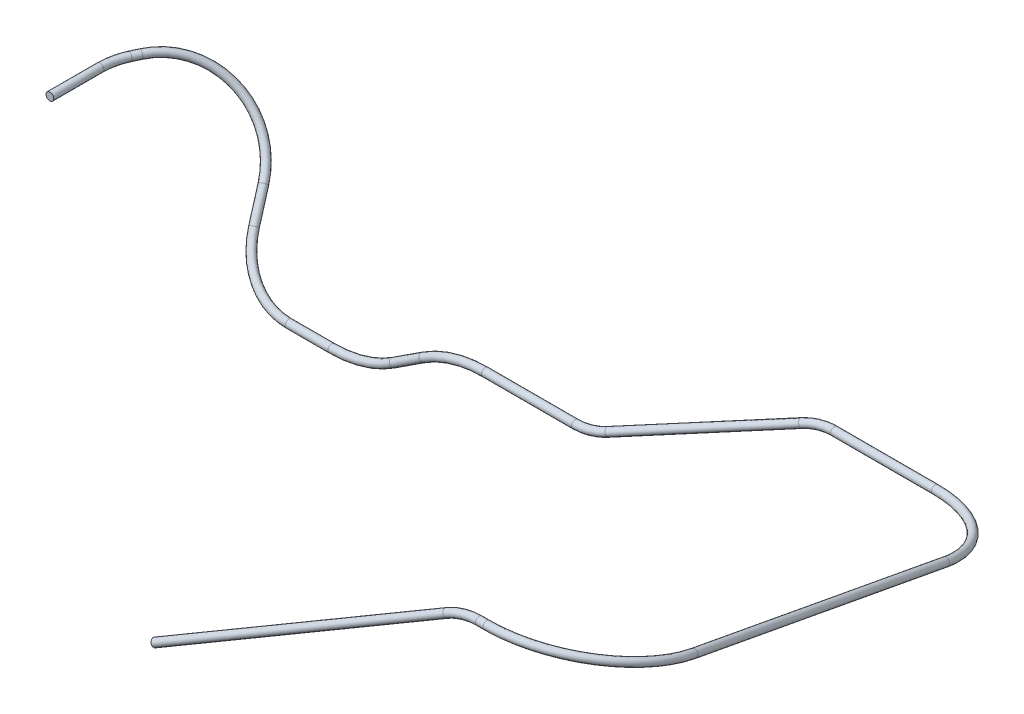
ISO-10303-21;
HEADER;
FILE_DESCRIPTION(('STEP AP214'),'2;1');
FILE_NAME('part.step','',(''),(''),'','','');
FILE_SCHEMA(('AUTOMOTIVE_DESIGN { 1 0 10303 214 1 1 1 1 }'));
ENDSEC;
DATA;
#1=APPLICATION_CONTEXT('core data for automotive mechanical design processes');
#2=APPLICATION_PROTOCOL_DEFINITION('international standard','automotive_design',2000,#1);
#3=PRODUCT_CONTEXT('',#1,'mechanical');
#4=PRODUCT('Part','Part','',(#3));
#5=PRODUCT_RELATED_PRODUCT_CATEGORY('part','',(#4));
#6=PRODUCT_DEFINITION_FORMATION('','',#4);
#7=PRODUCT_DEFINITION_CONTEXT('part definition',#1,'design');
#8=PRODUCT_DEFINITION('design','',#6,#7);
#9=PRODUCT_DEFINITION_SHAPE('','',#8);
#10=(LENGTH_UNIT() NAMED_UNIT(*) SI_UNIT(.MILLI.,.METRE.));
#11=(NAMED_UNIT(*) PLANE_ANGLE_UNIT() SI_UNIT($,.RADIAN.));
#12=(NAMED_UNIT(*) SI_UNIT($,.STERADIAN.) SOLID_ANGLE_UNIT());
#13=UNCERTAINTY_MEASURE_WITH_UNIT(LENGTH_MEASURE(1.E-05),#10,'distance_accuracy_value','');
#14=(GEOMETRIC_REPRESENTATION_CONTEXT(3) GLOBAL_UNCERTAINTY_ASSIGNED_CONTEXT((#13)) GLOBAL_UNIT_ASSIGNED_CONTEXT((#10,
#11,#12)) REPRESENTATION_CONTEXT('',''));
#15=CARTESIAN_POINT('',(0.,0.,0.));
#16=DIRECTION('',(0.,0.,1.));
#17=DIRECTION('',(1.,0.,0.));
#18=AXIS2_PLACEMENT_3D('',#15,#16,#17);
#19=CARTESIAN_POINT('',(0.,0.,0.));
#20=DIRECTION('',(0.,0.,1.));
#21=DIRECTION('',(1.,0.,0.));
#22=AXIS2_PLACEMENT_3D('',#19,#20,#21);
#23=PLANE('',#22);
#24=CARTESIAN_POINT('',(0.,0.,0.));
#25=DIRECTION('',(0.,0.,-1.));
#26=DIRECTION('',(-1.,0.,0.));
#27=AXIS2_PLACEMENT_3D('',#24,#25,#26);
#28=CIRCLE('',#27,0.7747);
#29=CARTESIAN_POINT('',(-0.7747,0.,0.));
#30=VERTEX_POINT('',#29);
#31=EDGE_CURVE('E18',#30,#30,#28,.T.);
#32=ORIENTED_EDGE('',*,*,#31,.F.);
#33=EDGE_LOOP('',(#32));
#34=FACE_BOUND('',#33,.T.);
#35=ADVANCED_FACE('F15',(#34),#23,.T.);
#36=CARTESIAN_POINT('',(0.,0.,0.));
#37=DIRECTION('',(0.,0.,-1.));
#38=DIRECTION('',(-1.,0.,0.));
#39=AXIS2_PLACEMENT_3D('',#36,#37,#38);
#40=CYLINDRICAL_SURFACE('',#39,0.7747);
#41=ORIENTED_EDGE('',*,*,#31,.T.);
#42=EDGE_LOOP('',(#41));
#43=FACE_BOUND('',#42,.T.);
#44=CARTESIAN_POINT('',(0.,0.,-10.1008338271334));
#45=DIRECTION('',(0.,0.,-1.));
#46=DIRECTION('',(-0.998630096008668,0.0523252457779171,0.));
#47=AXIS2_PLACEMENT_3D('',#44,#45,#46);
#48=CIRCLE('',#47,0.7747);
#49=CARTESIAN_POINT('',(-0.773638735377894,0.0405363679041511,-10.1008338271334));
#50=VERTEX_POINT('',#49);
#51=EDGE_CURVE('E198',#50,#50,#48,.T.);
#52=ORIENTED_EDGE('',*,*,#51,.F.);
#53=EDGE_LOOP('',(#52));
#54=FACE_BOUND('',#53,.T.);
#55=ADVANCED_FACE('F191',(#43,#54),#40,.T.);
#56=CARTESIAN_POINT('',(12.6826022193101,-0.664530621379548,-10.1008338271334));
#57=DIRECTION('',(-0.0523252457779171,-0.998630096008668,0.));
#58=DIRECTION('',(0.998630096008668,-0.0523252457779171,0.));
#59=AXIS2_PLACEMENT_3D('',#56,#57,#58);
#60=TOROIDAL_SURFACE('',#59,12.7,0.7747);
#61=ORIENTED_EDGE('',*,*,#51,.T.);
#62=EDGE_LOOP('',(#61));
#63=FACE_BOUND('',#62,.T.);
#64=CARTESIAN_POINT('',(1.01971579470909,-0.0534300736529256,-15.0901861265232));
#65=DIRECTION('',(0.392324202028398,-0.0205566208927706,-0.919597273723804));
#66=DIRECTION('',(-0.919791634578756,0.,-0.392407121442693));
#67=AXIS2_PLACEMENT_3D('',#64,#65,#66);
#68=CIRCLE('',#67,0.7747);
#69=CARTESIAN_POINT('',(0.307153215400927,-0.0534300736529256,-15.3941839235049));
#70=VERTEX_POINT('',#69);
#71=EDGE_CURVE('E201',#70,#70,#68,.T.);
#72=ORIENTED_EDGE('',*,*,#71,.F.);
#73=EDGE_LOOP('',(#72));
#74=FACE_BOUND('',#73,.T.);
#75=ADVANCED_FACE('F187',(#63,#74),#60,.T.);
#76=CARTESIAN_POINT('',(1.01971579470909,-0.0534300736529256,-15.0901861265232));
#77=DIRECTION('',(0.392324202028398,-0.0205566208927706,-0.919597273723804));
#78=DIRECTION('',(-0.919791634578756,0.,-0.392407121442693));
#79=AXIS2_PLACEMENT_3D('',#76,#77,#78);
#80=CYLINDRICAL_SURFACE('',#79,0.7747);
#81=ORIENTED_EDGE('',*,*,#71,.T.);
#82=EDGE_LOOP('',(#81));
#83=FACE_BOUND('',#82,.T.);
#84=CARTESIAN_POINT('',(1.67497659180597,-0.0877637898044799,-16.6260996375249));
#85=DIRECTION('',(0.392324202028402,-0.0205566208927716,-0.919597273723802));
#86=DIRECTION('',(-0.583290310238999,0.767473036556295,-0.266002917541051));
#87=AXIS2_PLACEMENT_3D('',#84,#85,#86);
#88=CIRCLE('',#87,0.7747);
#89=CARTESIAN_POINT('',(1.22310158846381,0.506797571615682,-16.8321720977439));
#90=VERTEX_POINT('',#89);
#91=EDGE_CURVE('E174',#90,#90,#88,.T.);
#92=ORIENTED_EDGE('',*,*,#91,.F.);
#93=EDGE_LOOP('',(#92));
#94=FACE_BOUND('',#93,.T.);
#95=ADVANCED_FACE('F183',(#83,#94),#80,.T.);
#96=CARTESIAN_POINT('',(10.4785734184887,-11.6712292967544,-12.6113193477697));
#97=DIRECTION('',(-0.71123423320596,-0.640751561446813,-0.289107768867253));
#98=DIRECTION('',(0.702955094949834,-0.648298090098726,-0.292512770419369));
#99=AXIS2_PLACEMENT_3D('',#96,#97,#98);
#100=TOROIDAL_SURFACE('',#99,15.09299344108,0.7747);
#101=ORIENTED_EDGE('',*,*,#91,.T.);
#102=EDGE_LOOP('',(#101));
#103=FACE_BOUND('',#102,.T.);
#104=CARTESIAN_POINT('',(19.688568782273,-17.0835573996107,-23.2734551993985));
#105=DIRECTION('',(0.348972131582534,-0.678855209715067,0.646044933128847));
#106=DIRECTION('',(0.,-0.68938439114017,-0.724395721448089));
#107=AXIS2_PLACEMENT_3D('',#104,#105,#106);
#108=CIRCLE('',#107,0.774700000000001);
#109=CARTESIAN_POINT('',(19.688568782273,-17.617623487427,-23.8346445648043));
#110=VERTEX_POINT('',#109);
#111=EDGE_CURVE('E169',#110,#110,#108,.T.);
#112=ORIENTED_EDGE('',*,*,#111,.F.);
#113=EDGE_LOOP('',(#112));
#114=FACE_BOUND('',#113,.T.);
#115=ADVANCED_FACE('F180',(#103,#114),#100,.T.);
#116=CARTESIAN_POINT('',(19.688568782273,-17.0835573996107,-23.2734551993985));
#117=DIRECTION('',(0.348972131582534,-0.678855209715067,0.646044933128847));
#118=DIRECTION('',(0.,-0.68938439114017,-0.724395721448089));
#119=AXIS2_PLACEMENT_3D('',#116,#117,#118);
#120=CYLINDRICAL_SURFACE('',#119,0.774700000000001);
#121=ORIENTED_EDGE('',*,*,#111,.T.);
#122=EDGE_LOOP('',(#121));
#123=FACE_BOUND('',#122,.T.);
#124=CARTESIAN_POINT('',(21.9045418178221,-21.3942879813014,-19.1710698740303));
#125=DIRECTION('',(0.348972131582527,-0.678855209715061,0.646044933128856));
#126=DIRECTION('',(-0.937133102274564,-0.252793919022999,0.24057594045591));
#127=AXIS2_PLACEMENT_3D('',#124,#125,#126);
#128=CIRCLE('',#127,0.774700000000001);
#129=CARTESIAN_POINT('',(21.17854480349,-21.5901274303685,-18.9846956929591));
#130=VERTEX_POINT('',#129);
#131=EDGE_CURVE('E165',#130,#130,#128,.T.);
#132=ORIENTED_EDGE('',*,*,#131,.F.);
#133=EDGE_LOOP('',(#132));
#134=FACE_BOUND('',#133,.T.);
#135=ADVANCED_FACE('F157',(#123,#134),#120,.T.);
#136=CARTESIAN_POINT('',(35.4164393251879,-17.7494209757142,-22.6397739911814));
#137=DIRECTION('',(0.,0.689384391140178,0.724395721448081));
#138=DIRECTION('',(1.,0.,0.));
#139=AXIS2_PLACEMENT_3D('',#136,#137,#138);
#140=TOROIDAL_SURFACE('',#139,14.4183333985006,0.774700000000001);
#141=ORIENTED_EDGE('',*,*,#131,.T.);
#142=EDGE_LOOP('',(#141));
#143=FACE_BOUND('',#142,.T.);
#144=CARTESIAN_POINT('',(35.4164393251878,-28.194,-12.7));
#145=DIRECTION('',(1.,0.,0.));
#146=DIRECTION('',(0.,0.,-1.));
#147=AXIS2_PLACEMENT_3D('',#144,#145,#146);
#148=CIRCLE('',#147,0.774700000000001);
#149=CARTESIAN_POINT('',(35.4164393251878,-28.194,-13.4747));
#150=VERTEX_POINT('',#149);
#151=EDGE_CURVE('E168',#150,#150,#148,.T.);
#152=ORIENTED_EDGE('',*,*,#151,.F.);
#153=EDGE_LOOP('',(#152));
#154=FACE_BOUND('',#153,.T.);
#155=ADVANCED_FACE('F152',(#143,#154),#140,.T.);
#156=CARTESIAN_POINT('',(35.4164393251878,-28.194,-12.7));
#157=DIRECTION('',(1.,0.,0.));
#158=DIRECTION('',(0.,0.,-1.));
#159=AXIS2_PLACEMENT_3D('',#156,#157,#158);
#160=CYLINDRICAL_SURFACE('',#159,0.774700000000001);
#161=ORIENTED_EDGE('',*,*,#151,.T.);
#162=EDGE_LOOP('',(#161));
#163=FACE_BOUND('',#162,.T.);
#164=CARTESIAN_POINT('',(44.0021066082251,-28.194,-12.7));
#165=DIRECTION('',(1.,0.,0.));
#166=DIRECTION('',(0.,-1.,0.));
#167=AXIS2_PLACEMENT_3D('',#164,#165,#166);
#168=CIRCLE('',#167,0.774700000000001);
#169=CARTESIAN_POINT('',(44.0021066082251,-28.9687,-12.7));
#170=VERTEX_POINT('',#169);
#171=EDGE_CURVE('E139',#170,#170,#168,.T.);
#172=ORIENTED_EDGE('',*,*,#171,.F.);
#173=EDGE_LOOP('',(#172));
#174=FACE_BOUND('',#173,.T.);
#175=ADVANCED_FACE('F148',(#163,#174),#160,.T.);
#176=CARTESIAN_POINT('',(44.0021066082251,-5.334,-12.7));
#177=DIRECTION('',(0.,0.,1.));
#178=DIRECTION('',(1.,0.,0.));
#179=AXIS2_PLACEMENT_3D('',#176,#177,#178);
#180=TOROIDAL_SURFACE('',#179,22.86,0.774700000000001);
#181=ORIENTED_EDGE('',*,*,#171,.T.);
#182=EDGE_LOOP('',(#181));
#183=FACE_BOUND('',#182,.T.);
#184=CARTESIAN_POINT('',(56.493305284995,-24.4794839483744,-12.7));
#185=DIRECTION('',(0.83751023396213,0.546421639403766,0.));
#186=DIRECTION('',(-0.546421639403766,0.83751023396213,0.));
#187=AXIS2_PLACEMENT_3D('',#184,#185,#186);
#188=CIRCLE('',#187,0.774700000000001);
#189=CARTESIAN_POINT('',(56.0699924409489,-23.8306647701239,-12.7));
#190=VERTEX_POINT('',#189);
#191=EDGE_CURVE('E134',#190,#190,#188,.T.);
#192=ORIENTED_EDGE('',*,*,#191,.F.);
#193=EDGE_LOOP('',(#192));
#194=FACE_BOUND('',#193,.T.);
#195=ADVANCED_FACE('F145',(#183,#194),#180,.T.);
#196=CARTESIAN_POINT('',(56.493305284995,-24.4794839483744,-12.7));
#197=DIRECTION('',(0.83751023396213,0.546421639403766,0.));
#198=DIRECTION('',(-0.546421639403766,0.83751023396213,0.));
#199=AXIS2_PLACEMENT_3D('',#196,#197,#198);
#200=CYLINDRICAL_SURFACE('',#199,0.774700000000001);
#201=ORIENTED_EDGE('',*,*,#191,.T.);
#202=EDGE_LOOP('',(#201));
#203=FACE_BOUND('',#202,.T.);
#204=CARTESIAN_POINT('',(62.4112423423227,-20.6184100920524,-12.7));
#205=DIRECTION('',(0.837510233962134,0.546421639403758,0.));
#206=DIRECTION('',(-0.546421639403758,0.837510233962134,0.));
#207=AXIS2_PLACEMENT_3D('',#204,#205,#206);
#208=CIRCLE('',#207,0.774700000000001);
#209=CARTESIAN_POINT('',(61.9879294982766,-19.969590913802,-12.7));
#210=VERTEX_POINT('',#209);
#211=EDGE_CURVE('E130',#210,#210,#208,.T.);
#212=ORIENTED_EDGE('',*,*,#211,.F.);
#213=EDGE_LOOP('',(#212));
#214=FACE_BOUND('',#213,.T.);
#215=ADVANCED_FACE('F122',(#203,#214),#200,.T.);
#216=CARTESIAN_POINT('',(74.9024410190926,-39.7638940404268,-12.7));
#217=DIRECTION('',(0.,0.,-1.));
#218=DIRECTION('',(1.,0.,0.));
#219=AXIS2_PLACEMENT_3D('',#216,#217,#218);
#220=TOROIDAL_SURFACE('',#219,22.86,0.774700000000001);
#221=ORIENTED_EDGE('',*,*,#211,.T.);
#222=EDGE_LOOP('',(#221));
#223=FACE_BOUND('',#222,.T.);
#224=CARTESIAN_POINT('',(74.9024410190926,-16.9038940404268,-12.7));
#225=DIRECTION('',(1.,0.,0.));
#226=DIRECTION('',(0.,0.,-1.));
#227=AXIS2_PLACEMENT_3D('',#224,#225,#226);
#228=CIRCLE('',#227,0.774700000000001);
#229=CARTESIAN_POINT('',(74.9024410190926,-16.9038940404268,-13.4747));
#230=VERTEX_POINT('',#229);
#231=EDGE_CURVE('E133',#230,#230,#228,.T.);
#232=ORIENTED_EDGE('',*,*,#231,.F.);
#233=EDGE_LOOP('',(#232));
#234=FACE_BOUND('',#233,.T.);
#235=ADVANCED_FACE('F117',(#223,#234),#220,.T.);
#236=CARTESIAN_POINT('',(74.9024410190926,-16.9038940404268,-12.7));
#237=DIRECTION('',(1.,0.,0.));
#238=DIRECTION('',(0.,0.,-1.));
#239=AXIS2_PLACEMENT_3D('',#236,#237,#238);
#240=CYLINDRICAL_SURFACE('',#239,0.774700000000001);
#241=ORIENTED_EDGE('',*,*,#231,.T.);
#242=EDGE_LOOP('',(#241));
#243=FACE_BOUND('',#242,.T.);
#244=CARTESIAN_POINT('',(93.0384381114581,-16.9038940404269,-12.7));
#245=DIRECTION('',(1.,0.,0.));
#246=DIRECTION('',(0.,-0.779129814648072,0.626862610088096));
#247=AXIS2_PLACEMENT_3D('',#244,#245,#246);
#248=CIRCLE('',#247,0.774700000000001);
#249=CARTESIAN_POINT('',(93.0384381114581,-17.5074859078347,-12.2143695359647));
#250=VERTEX_POINT('',#249);
#251=EDGE_CURVE('E102',#250,#250,#248,.T.);
#252=ORIENTED_EDGE('',*,*,#251,.F.);
#253=EDGE_LOOP('',(#252));
#254=FACE_BOUND('',#253,.T.);
#255=ADVANCED_FACE('F113',(#243,#254),#240,.T.);
#256=CARTESIAN_POINT('',(98.9766772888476,-6.72868078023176,77.8585446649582));
#257=DIRECTION('',(0.878168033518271,0.454499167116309,-0.149169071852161));
#258=DIRECTION('',(-0.459641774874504,0.888104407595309,0.));
#259=AXIS2_PLACEMENT_3D('',#256,#257,#258);
#260=PLANE('',#259);
#261=CARTESIAN_POINT('',(98.9766772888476,-6.72868078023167,77.8585446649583));
#262=DIRECTION('',(-0.878168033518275,-0.454499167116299,0.149169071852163));
#263=DIRECTION('',(0.459641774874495,-0.888104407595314,0.));
#264=AXIS2_PLACEMENT_3D('',#261,#262,#263);
#265=CIRCLE('',#264,0.774700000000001);
#266=CARTESIAN_POINT('',(99.3327617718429,-7.41669526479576,77.8585446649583));
#267=VERTEX_POINT('',#266);
#268=EDGE_CURVE('E97',#267,#267,#265,.F.);
#269=ORIENTED_EDGE('',*,*,#268,.F.);
#270=EDGE_LOOP('',(#269));
#271=FACE_BOUND('',#270,.T.);
#272=ADVANCED_FACE('F109',(#271),#260,.F.);
#273=CARTESIAN_POINT('',(93.0384381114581,-7.00894539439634,-20.6611551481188));
#274=DIRECTION('',(0.,0.626862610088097,0.779129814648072));
#275=DIRECTION('',(1.,0.,0.));
#276=AXIS2_PLACEMENT_3D('',#273,#274,#275);
#277=TOROIDAL_SURFACE('',#276,12.7,0.774700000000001);
#278=ORIENTED_EDGE('',*,*,#251,.T.);
#279=EDGE_LOOP('',(#278));
#280=FACE_BOUND('',#279,.T.);
#281=CARTESIAN_POINT('',(98.7661993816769,-15.8403999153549,-13.5556529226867));
#282=DIRECTION('',(0.892521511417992,0.351391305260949,-0.282718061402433));
#283=DIRECTION('',(-0.366336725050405,0.930482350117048,0.));
#284=AXIS2_PLACEMENT_3D('',#281,#282,#283);
#285=CIRCLE('',#284,0.774700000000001);
#286=CARTESIAN_POINT('',(98.4823983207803,-15.1195552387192,-13.5556529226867));
#287=VERTEX_POINT('',#286);
#288=EDGE_CURVE('E92',#287,#287,#285,.T.);
#289=ORIENTED_EDGE('',*,*,#288,.F.);
#290=EDGE_LOOP('',(#289));
#291=FACE_BOUND('',#290,.T.);
#292=ADVANCED_FACE('F105',(#280,#291),#277,.T.);
#293=CARTESIAN_POINT('',(149.163980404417,19.2459466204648,69.3335322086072));
#294=DIRECTION('',(-0.878168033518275,-0.454499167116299,0.149169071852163));
#295=DIRECTION('',(0.459641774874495,-0.888104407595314,0.));
#296=AXIS2_PLACEMENT_3D('',#293,#294,#295);
#297=CYLINDRICAL_SURFACE('',#296,0.774700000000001);
#298=CARTESIAN_POINT('',(149.163980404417,19.2459466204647,69.3335322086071));
#299=DIRECTION('',(-0.87816803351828,-0.454499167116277,0.1491690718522));
#300=DIRECTION('',(-0.478352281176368,0.834378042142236,-0.273847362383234));
#301=AXIS2_PLACEMENT_3D('',#298,#299,#300);
#302=CIRCLE('',#301,0.774700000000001);
#303=CARTESIAN_POINT('',(148.79340089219,19.8923392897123,69.1213826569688));
#304=VERTEX_POINT('',#303);
#305=EDGE_CURVE('E89',#304,#304,#302,.F.);
#306=ORIENTED_EDGE('',*,*,#305,.F.);
#307=EDGE_LOOP('',(#306));
#308=FACE_BOUND('',#307,.T.);
#309=ORIENTED_EDGE('',*,*,#268,.T.);
#310=EDGE_LOOP('',(#309));
#311=FACE_BOUND('',#310,.T.);
#312=ADVANCED_FACE('F108',(#308,#311),#297,.T.);
#313=CARTESIAN_POINT('',(98.7661993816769,-15.8403999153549,-13.5556529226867));
#314=DIRECTION('',(0.892521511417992,0.351391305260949,-0.282718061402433));
#315=DIRECTION('',(-0.366336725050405,0.930482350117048,0.));
#316=AXIS2_PLACEMENT_3D('',#313,#314,#315);
#317=CYLINDRICAL_SURFACE('',#316,0.774700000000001);
#318=ORIENTED_EDGE('',*,*,#288,.T.);
#319=EDGE_LOOP('',(#318));
#320=FACE_BOUND('',#319,.T.);
#321=CARTESIAN_POINT('',(128.344262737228,-4.19533124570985,-22.9248979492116));
#322=DIRECTION('',(0.892521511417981,0.351391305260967,-0.282718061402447));
#323=DIRECTION('',(-0.451004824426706,0.695390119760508,-0.559488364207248));
#324=AXIS2_PLACEMENT_3D('',#321,#322,#323);
#325=CIRCLE('',#324,0.774700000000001);
#326=CARTESIAN_POINT('',(127.994869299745,-3.65661251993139,-23.358333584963));
#327=VERTEX_POINT('',#326);
#328=EDGE_CURVE('E67',#327,#327,#325,.T.);
#329=ORIENTED_EDGE('',*,*,#328,.F.);
#330=EDGE_LOOP('',(#329));
#331=FACE_BOUND('',#330,.T.);
#332=ADVANCED_FACE('F83',(#320,#331),#317,.T.);
#333=CARTESIAN_POINT('',(155.239054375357,8.64934548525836,72.8113937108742));
#334=DIRECTION('',(0.,0.311839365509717,0.95013483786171));
#335=DIRECTION('',(1.,0.,0.));
#336=AXIS2_PLACEMENT_3D('',#333,#334,#335);
#337=TOROIDAL_SURFACE('',#336,12.7,0.774700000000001);
#338=CARTESIAN_POINT('',(155.239054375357,20.7160579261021,68.8510337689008));
#339=DIRECTION('',(-1.,0.,0.));
#340=DIRECTION('',(0.,0.,1.));
#341=AXIS2_PLACEMENT_3D('',#338,#339,#340);
#342=CIRCLE('',#341,0.774700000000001);
#343=CARTESIAN_POINT('',(155.239054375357,20.7160579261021,69.6257337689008));
#344=VERTEX_POINT('',#343);
#345=EDGE_CURVE('E62',#344,#344,#342,.F.);
#346=ORIENTED_EDGE('',*,*,#345,.F.);
#347=EDGE_LOOP('',(#346));
#348=FACE_BOUND('',#347,.T.);
#349=ORIENTED_EDGE('',*,*,#305,.T.);
#350=EDGE_LOOP('',(#349));
#351=FACE_BOUND('',#350,.T.);
#352=ADVANCED_FACE('F78',(#348,#351),#337,.T.);
#353=CARTESIAN_POINT('',(134.072024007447,-13.0267857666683,-15.8193957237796));
#354=DIRECTION('',(0.,-0.626862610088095,-0.779129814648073));
#355=DIRECTION('',(1.,0.,0.));
#356=AXIS2_PLACEMENT_3D('',#353,#354,#355);
#357=TOROIDAL_SURFACE('',#356,12.7,0.774700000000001);
#358=ORIENTED_EDGE('',*,*,#328,.T.);
#359=EDGE_LOOP('',(#358));
#360=FACE_BOUND('',#359,.T.);
#361=CARTESIAN_POINT('',(134.072024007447,-3.13183712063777,-23.7805508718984));
#362=DIRECTION('',(1.,0.,0.));
#363=DIRECTION('',(0.,1.,0.));
#364=AXIS2_PLACEMENT_3D('',#361,#362,#363);
#365=CIRCLE('',#364,0.774700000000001);
#366=CARTESIAN_POINT('',(134.072024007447,-2.35713712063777,-23.7805508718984));
#367=VERTEX_POINT('',#366);
#368=EDGE_CURVE('E57',#367,#367,#365,.T.);
#369=ORIENTED_EDGE('',*,*,#368,.F.);
#370=EDGE_LOOP('',(#369));
#371=FACE_BOUND('',#370,.T.);
#372=ADVANCED_FACE('F74',(#360,#371),#357,.T.);
#373=CARTESIAN_POINT('',(156.782349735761,20.7160579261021,68.8510337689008));
#374=DIRECTION('',(-1.,0.,0.));
#375=DIRECTION('',(0.,0.,1.));
#376=AXIS2_PLACEMENT_3D('',#373,#374,#375);
#377=CYLINDRICAL_SURFACE('',#376,0.774700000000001);
#378=CARTESIAN_POINT('',(156.782349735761,20.7160579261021,68.8510337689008));
#379=DIRECTION('',(-1.,0.,0.));
#380=DIRECTION('',(0.,0.249318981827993,0.968421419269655));
#381=AXIS2_PLACEMENT_3D('',#378,#379,#380);
#382=CIRCLE('',#381,0.774700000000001);
#383=CARTESIAN_POINT('',(156.782349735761,20.9092053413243,69.601269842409));
#384=VERTEX_POINT('',#383);
#385=EDGE_CURVE('E54',#384,#384,#382,.F.);
#386=ORIENTED_EDGE('',*,*,#385,.F.);
#387=EDGE_LOOP('',(#386));
#388=FACE_BOUND('',#387,.T.);
#389=ORIENTED_EDGE('',*,*,#345,.T.);
#390=EDGE_LOOP('',(#389));
#391=FACE_BOUND('',#390,.T.);
#392=ADVANCED_FACE('F77',(#388,#391),#377,.T.);
#393=CARTESIAN_POINT('',(134.072024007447,-3.13183712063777,-23.7805508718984));
#394=DIRECTION('',(1.,0.,0.));
#395=DIRECTION('',(0.,1.,0.));
#396=AXIS2_PLACEMENT_3D('',#393,#394,#395);
#397=CYLINDRICAL_SURFACE('',#396,0.774700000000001);
#398=ORIENTED_EDGE('',*,*,#368,.T.);
#399=EDGE_LOOP('',(#398));
#400=FACE_BOUND('',#399,.T.);
#401=CARTESIAN_POINT('',(154.397864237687,-3.1318371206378,-23.7805508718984));
#402=DIRECTION('',(1.,0.,0.));
#403=DIRECTION('',(0.,-0.249318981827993,-0.968421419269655));
#404=AXIS2_PLACEMENT_3D('',#401,#402,#403);
#405=CIRCLE('',#404,0.774700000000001);
#406=CARTESIAN_POINT('',(154.397864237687,-3.32498453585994,-24.5307869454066));
#407=VERTEX_POINT('',#406);
#408=EDGE_CURVE('E27',#407,#407,#405,.T.);
#409=ORIENTED_EDGE('',*,*,#408,.F.);
#410=EDGE_LOOP('',(#409));
#411=FACE_BOUND('',#410,.T.);
#412=ADVANCED_FACE('F48',(#400,#411),#397,.T.);
#413=CARTESIAN_POINT('',(156.782349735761,15.6498962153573,49.1727105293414));
#414=DIRECTION('',(0.,-0.968421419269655,0.249318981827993));
#415=DIRECTION('',(1.,0.,0.));
#416=AXIS2_PLACEMENT_3D('',#413,#414,#415);
#417=TOROIDAL_SURFACE('',#416,20.32,0.774700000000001);
#418=CARTESIAN_POINT('',(177.028090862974,15.2171739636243,47.4919018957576));
#419=DIRECTION('',(0.0854142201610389,0.2484078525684,0.964882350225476));
#420=DIRECTION('',(0.,-0.968421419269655,0.249318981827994));
#421=AXIS2_PLACEMENT_3D('',#418,#419,#420);
#422=CIRCLE('',#421,0.774700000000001);
#423=CARTESIAN_POINT('',(177.028090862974,14.4669378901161,47.6850493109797));
#424=VERTEX_POINT('',#423);
#425=EDGE_CURVE('E22',#424,#424,#422,.F.);
#426=ORIENTED_EDGE('',*,*,#425,.F.);
#427=EDGE_LOOP('',(#426));
#428=FACE_BOUND('',#427,.T.);
#429=ORIENTED_EDGE('',*,*,#385,.T.);
#430=EDGE_LOOP('',(#429));
#431=FACE_BOUND('',#430,.T.);
#432=ADVANCED_FACE('F43',(#428,#431),#417,.T.);
#433=CARTESIAN_POINT('',(154.397864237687,1.30105437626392,-6.56201803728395));
#434=DIRECTION('',(0.,-0.968421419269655,0.249318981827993));
#435=DIRECTION('',(1.,0.,0.));
#436=AXIS2_PLACEMENT_3D('',#433,#434,#435);
#437=TOROIDAL_SURFACE('',#436,17.78,0.774700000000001);
#438=ORIENTED_EDGE('',*,*,#408,.T.);
#439=EDGE_LOOP('',(#438));
#440=FACE_BOUND('',#439,.T.);
#441=CARTESIAN_POINT('',(172.112887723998,0.922422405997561,-8.03272559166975));
#442=DIRECTION('',(0.0854142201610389,0.2484078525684,0.964882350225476));
#443=DIRECTION('',(0.,-0.968421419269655,0.249318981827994));
#444=AXIS2_PLACEMENT_3D('',#441,#442,#443);
#445=CIRCLE('',#444,0.774700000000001);
#446=CARTESIAN_POINT('',(172.112887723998,0.172186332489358,-7.83957817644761));
#447=VERTEX_POINT('',#446);
#448=EDGE_CURVE('E10',#447,#447,#445,.T.);
#449=ORIENTED_EDGE('',*,*,#448,.F.);
#450=EDGE_LOOP('',(#449));
#451=FACE_BOUND('',#450,.T.);
#452=ADVANCED_FACE('F38',(#440,#451),#437,.T.);
#453=CARTESIAN_POINT('',(172.112887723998,0.922422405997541,-8.03272559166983));
#454=DIRECTION('',(0.0854142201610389,0.2484078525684,0.964882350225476));
#455=DIRECTION('',(0.,-0.968421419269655,0.249318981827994));
#456=AXIS2_PLACEMENT_3D('',#453,#454,#455);
#457=CYLINDRICAL_SURFACE('',#456,0.774700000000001);
#458=ORIENTED_EDGE('',*,*,#448,.T.);
#459=EDGE_LOOP('',(#458));
#460=FACE_BOUND('',#459,.T.);
#461=ORIENTED_EDGE('',*,*,#425,.T.);
#462=EDGE_LOOP('',(#461));
#463=FACE_BOUND('',#462,.T.);
#464=ADVANCED_FACE('F42',(#460,#463),#457,.T.);
#465=CLOSED_SHELL('',(#35,#55,#75,#95,#115,#135,#155,#175,#195,#215,#235,#255,#272,#292,#312,
#332,#352,#372,#392,#412,#432,#452,#464));
#466=MANIFOLD_SOLID_BREP('B1',#465);
#467=ADVANCED_BREP_SHAPE_REPRESENTATION('',(#18,#466),#14);
#468=SHAPE_DEFINITION_REPRESENTATION(#9,#467);
ENDSEC;
END-ISO-10303-21;
